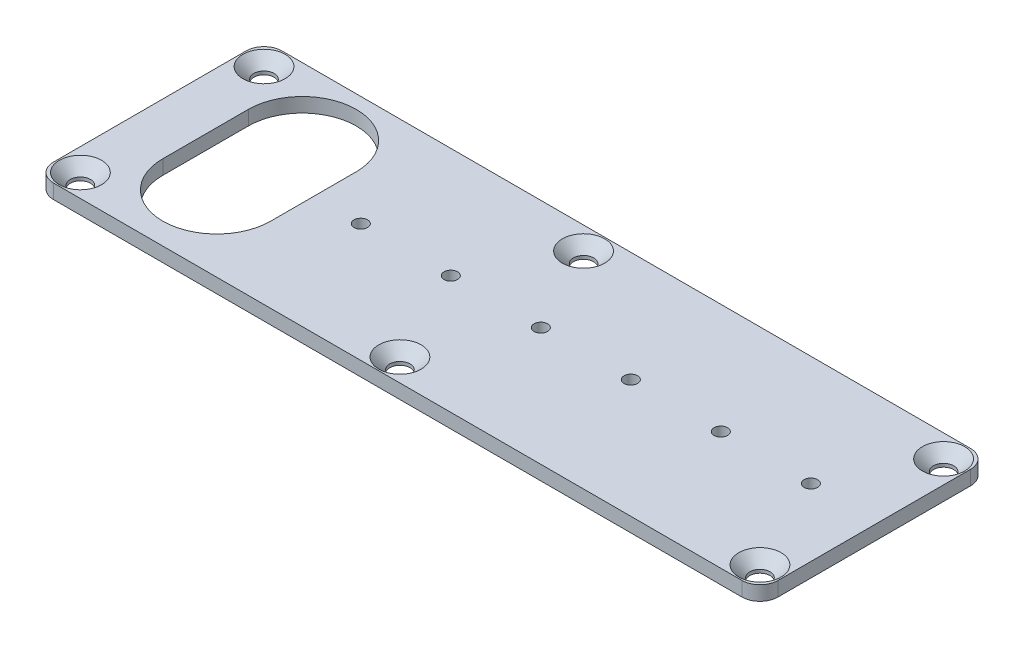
from build123d import *

# Parameters (mm, degrees)
SKETCH1_W                                       = 161
SKETCH1_H                                       = 50.8
BOSS_EXTRUDE1_DEPTH                             = 3.2
SKETCH2_R                                       = 1.5
CUT_EXTRUDE2_DEPTH                              = 169.854612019
FILLET1_R                                       = 4
CSK_FOR_M4_FLAT_HEAD_MACHINE_SCREW1_D           = 4.5
CSK_FOR_M4_FLAT_HEAD_MACHINE_SCREW1_DEPTH       = 5
CSK_FOR_M4_FLAT_HEAD_MACHINE_SCREW1_CSINK_D     = 9.4
CSK_FOR_M4_FLAT_HEAD_MACHINE_SCREW1_CSINK_ANGLE = 90
CSK_FOR_M4_FLAT_HEAD_MACHINE_SCREW1_TIP         = 1.351936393


with BuildPart() as part:
    # Sketch1 → Boss-Extrude1 (new body)
    with BuildSketch(Plane(origin=(0, 0, 0), x_dir=(1, 0, 0), z_dir=(0, 1, 0))):
        with Locations((80.5, 25.4)):
            Rectangle(SKETCH1_W, SKETCH1_H)
    extrude(amount=BOSS_EXTRUDE1_DEPTH)

    # Sketch2 → Cut-Extrude2 (cut, through all)
    with BuildSketch(Plane(origin=(0, 3.2, 0), x_dir=(1, 0, 0), z_dir=(0, 1, 0))):
        with Locations(Location((146, 26.3, 0), (0, 0, 270))):
            Circle(SKETCH2_R)
        with Locations(Location((126, 26.3, 0), (0, 0, 270))):
            Circle(SKETCH2_R)
        with Locations(Location((106, 26.3, 0), (0, 0, 270))):
            Circle(SKETCH2_R)
        with Locations(Location((86, 26.3, 0), (0, 0, 270))):
            Circle(SKETCH2_R)
        with Locations(Location((66, 26.3, 0), (0, 0, 270))):
            Circle(SKETCH2_R)
        with Locations(Location((46, 26.3, 0), (0, 0, 270))):
            Circle(SKETCH2_R)
        with BuildLine():
            Line((35.5, 35.8), (35.5, 16.8))
            ThreePointArc((35.5, 16.8), (23.5, 4.8), (11.5, 16.8))
            Line((11.5, 16.8), (11.5, 35.8))
            ThreePointArc((11.5, 35.8), (23.5, 47.8), (35.5, 35.8))
        make_face()
    extrude(amount=-CUT_EXTRUDE2_DEPTH, mode=Mode.SUBTRACT)

    # Fillet1
    fillet1_edges = [part.edges().sort_by_distance(p)[0] for p in [
        (0, 1.6, -50.8),
        (161, 1.6, -50.8),
        (161, 1.6, 0),
        (0, 1.6, 0),
    ]]
    fillet(fillet1_edges, radius=FILLET1_R)

    # CSK for M4 Flat Head Machine Screw1
    with Locations(Plane(origin=(0, 3.2, 0), x_dir=(1, 0, 0), z_dir=(0, 1, 0))):
        with Locations((156, 5), (76, 5), (5, 5), (5, 45.8), (76, 45.8), (156, 45.8)):
            CounterSinkHole(CSK_FOR_M4_FLAT_HEAD_MACHINE_SCREW1_D / 2, CSK_FOR_M4_FLAT_HEAD_MACHINE_SCREW1_CSINK_D / 2, depth=CSK_FOR_M4_FLAT_HEAD_MACHINE_SCREW1_DEPTH, counter_sink_angle=CSK_FOR_M4_FLAT_HEAD_MACHINE_SCREW1_CSINK_ANGLE)
            with Locations((0, 0, -(CSK_FOR_M4_FLAT_HEAD_MACHINE_SCREW1_DEPTH + CSK_FOR_M4_FLAT_HEAD_MACHINE_SCREW1_TIP / 2))):  # 118° drill point
                Cone(0, CSK_FOR_M4_FLAT_HEAD_MACHINE_SCREW1_D / 2, CSK_FOR_M4_FLAT_HEAD_MACHINE_SCREW1_TIP, mode=Mode.SUBTRACT)


solid = part.part
